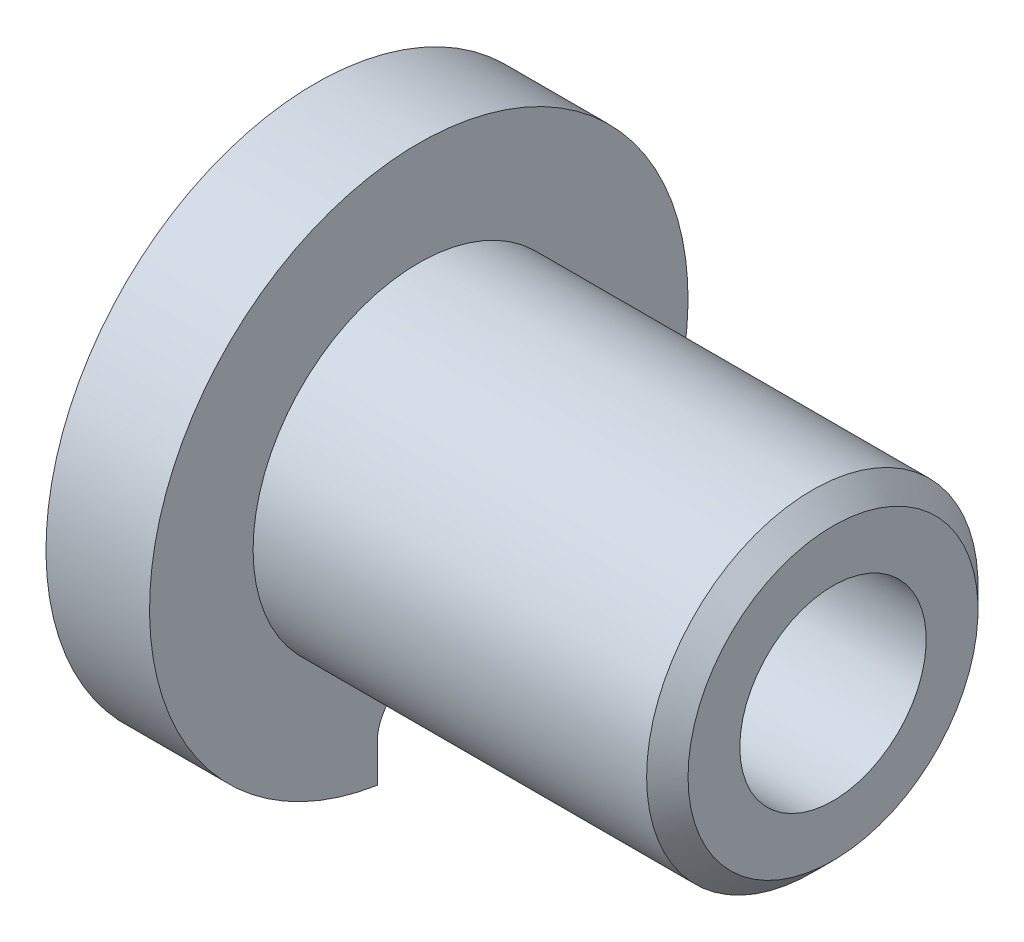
from build123d import *

# Parameters (mm, degrees)
CHANFREIN2_SIZE         = 1
ENL_V_MAT_EXTRU_1_DEPTH = 32.032241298


with BuildPart() as part:
    # Esquisse1 → Base-R_volution (revolve)
    with BuildSketch(Plane.XY, mode=Mode.PRIVATE) as base_r_volution_sk:
        Polygon((0, 4.5), (25, 4.5), (25, 8), (5, 8), (5, 13), (0, 13), align=None)
    revolve(base_r_volution_sk.sketch.rotate(Axis((0, 0, 0), (1, 0, 0)), 90), axis=Axis((0, 0, 0), (1, 0, 0)))

    # Chanfrein2
    chanfrein2_edges = [part.edges().sort_by_distance(p)[0] for p in [
        (25, 0, -8),
    ]]
    chamfer(chanfrein2_edges, length=CHANFREIN2_SIZE)

    # Esquisse2 → Enl_v. mat.-Extru.1 (cut, through all)
    with BuildSketch(Plane.ZY):
        with BuildLine():
            Line((2, -11), (2, -12.845232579))
            ThreePointArc((2, -12.845232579), (0, -13), (-2, -12.845232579))
            Line((-2, -12.845232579), (-2, -11))
            ThreePointArc((-2, -11), (0, -9), (2, -11))
        make_face()
    extrude(amount=-ENL_V_MAT_EXTRU_1_DEPTH, mode=Mode.SUBTRACT)


solid = part.part
